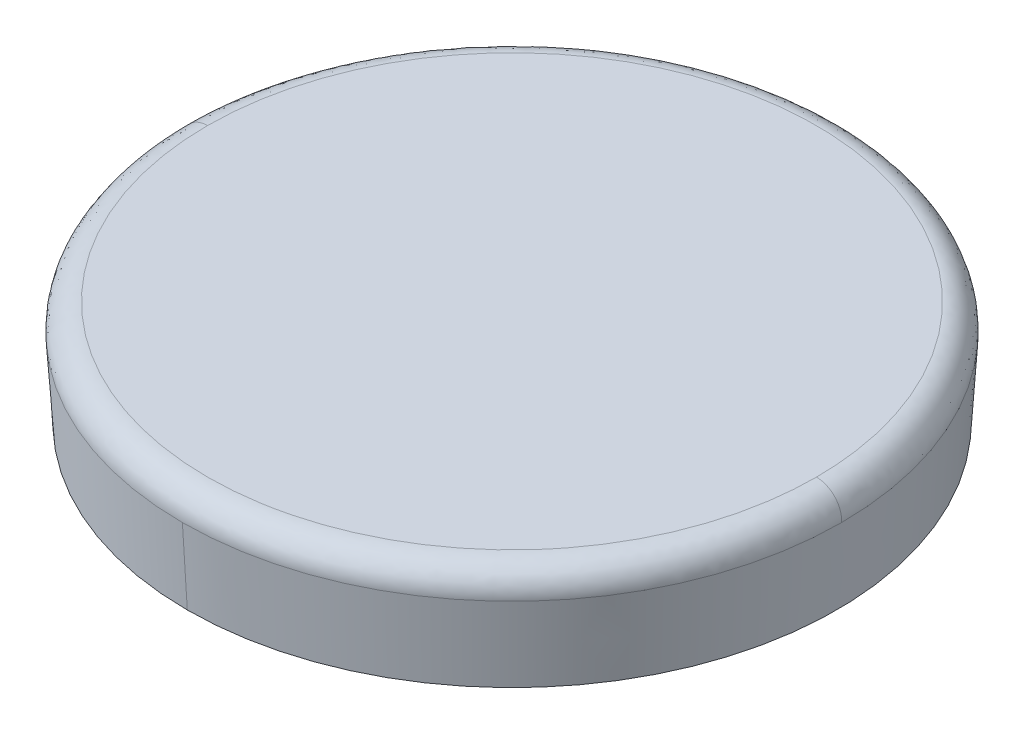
ISO-10303-21;
HEADER;
FILE_DESCRIPTION(('STEP AP214'),'2;1');
FILE_NAME('part.step','',(''),(''),'','','');
FILE_SCHEMA(('AUTOMOTIVE_DESIGN { 1 0 10303 214 1 1 1 1 }'));
ENDSEC;
DATA;
#1=APPLICATION_CONTEXT('core data for automotive mechanical design processes');
#2=APPLICATION_PROTOCOL_DEFINITION('international standard','automotive_design',2000,#1);
#3=PRODUCT_CONTEXT('',#1,'mechanical');
#4=PRODUCT('Part','Part','',(#3));
#5=PRODUCT_RELATED_PRODUCT_CATEGORY('part','',(#4));
#6=PRODUCT_DEFINITION_FORMATION('','',#4);
#7=PRODUCT_DEFINITION_CONTEXT('part definition',#1,'design');
#8=PRODUCT_DEFINITION('design','',#6,#7);
#9=PRODUCT_DEFINITION_SHAPE('','',#8);
#10=(LENGTH_UNIT() NAMED_UNIT(*) SI_UNIT(.MILLI.,.METRE.));
#11=(NAMED_UNIT(*) PLANE_ANGLE_UNIT() SI_UNIT($,.RADIAN.));
#12=(NAMED_UNIT(*) SI_UNIT($,.STERADIAN.) SOLID_ANGLE_UNIT());
#13=UNCERTAINTY_MEASURE_WITH_UNIT(LENGTH_MEASURE(1.E-05),#10,'distance_accuracy_value','');
#14=(GEOMETRIC_REPRESENTATION_CONTEXT(3) GLOBAL_UNCERTAINTY_ASSIGNED_CONTEXT((#13)) GLOBAL_UNIT_ASSIGNED_CONTEXT((#10,
#11,#12)) REPRESENTATION_CONTEXT('',''));
#15=CARTESIAN_POINT('',(0.,0.,0.));
#16=DIRECTION('',(0.,0.,1.));
#17=DIRECTION('',(1.,0.,0.));
#18=AXIS2_PLACEMENT_3D('',#15,#16,#17);
#19=CARTESIAN_POINT('',(-3.61599508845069,13.2498648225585,-2.75));
#20=CARTESIAN_POINT('',(-3.61599508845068,13.2498648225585,4.48199017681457));
#21=CARTESIAN_POINT('',(3.61599508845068,13.2498648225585,4.48199017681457));
#22=CARTESIAN_POINT('',(3.61599508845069,13.2498648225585,-2.75));
#23=CARTESIAN_POINT('',(-3.80475791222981,13.2555333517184,-2.75));
#24=CARTESIAN_POINT('',(-3.80475791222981,13.2555333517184,4.85951582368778));
#25=CARTESIAN_POINT('',(3.80475791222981,13.2555333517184,4.85951582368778));
#26=CARTESIAN_POINT('',(3.80475791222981,13.2555333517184,-2.75));
#27=CARTESIAN_POINT('',(-3.93676554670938,13.1198054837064,-2.75));
#28=CARTESIAN_POINT('',(-3.93676554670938,13.1198054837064,5.1235310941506));
#29=CARTESIAN_POINT('',(3.93676554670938,13.1198054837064,5.1235310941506));
#30=CARTESIAN_POINT('',(3.93676554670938,13.1198054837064,-2.75));
#31=CARTESIAN_POINT('',(-3.92435848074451,12.9303913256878,-2.75));
#32=CARTESIAN_POINT('',(-3.92435848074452,12.9303913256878,5.0987169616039));
#33=CARTESIAN_POINT('',(3.92435848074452,12.9303913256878,5.0987169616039));
#34=CARTESIAN_POINT('',(3.92435848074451,12.9303913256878,-2.75));
#35=(BOUNDED_SURFACE() B_SPLINE_SURFACE(3,3,((#19,#20,#21,#22),(#23,#24,#25,#26),(#27,#28,#29,
#30),(#31,#32,#33,#34)),.UNSPECIFIED.,.F.,.F.,.F.) B_SPLINE_SURFACE_WITH_KNOTS((4,4),(4,4),
(0.0433589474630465,0.94015159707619),(0.,1.),
.UNSPECIFIED.) GEOMETRIC_REPRESENTATION_ITEM() RATIONAL_B_SPLINE_SURFACE(((0.96751722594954,
0.32250574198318,0.32250574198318,0.96751722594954),(0.753720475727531,0.251240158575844,
0.251240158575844,0.753720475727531),(0.749860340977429,0.249953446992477,0.249953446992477,
0.749860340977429),(0.955936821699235,0.318645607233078,0.318645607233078,0.955936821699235))) REPRESENTATION_ITEM('') SURFACE());
#36=CARTESIAN_POINT('',(0.,12.931231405,-2.75));
#37=DIRECTION('',(0.,1.,0.));
#38=DIRECTION('',(-1.,0.,0.));
#39=AXIS2_PLACEMENT_3D('',#36,#37,#38);
#40=CIRCLE('',#39,3.924412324);
#41=CARTESIAN_POINT('',(-3.92441232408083,12.9312314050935,-2.75));
#42=VERTEX_POINT('',#41);
#43=CARTESIAN_POINT('',(0.,12.931231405,1.174412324));
#44=VERTEX_POINT('',#43);
#45=EDGE_CURVE('E77',#42,#44,#40,.T.);
#46=CARTESIAN_POINT('',(0.,12.931231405,-2.75));
#47=DIRECTION('',(0.,1.,0.));
#48=DIRECTION('',(-1.,0.,0.));
#49=AXIS2_PLACEMENT_3D('',#46,#47,#48);
#50=CIRCLE('',#49,3.924412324);
#51=CARTESIAN_POINT('',(3.92441232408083,12.9312314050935,-2.75000000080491));
#52=VERTEX_POINT('',#51);
#53=EDGE_CURVE('E102',#44,#52,#50,.T.);
#54=CARTESIAN_POINT('',(3.92441232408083,12.9312314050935,-2.75000000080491));
#55=CARTESIAN_POINT('',(3.93596043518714,13.1154565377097,-2.75));
#56=CARTESIAN_POINT('',(3.8095867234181,13.2500000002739,-2.75));
#57=CARTESIAN_POINT('',(3.62499999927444,13.250000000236,-2.75));
#58=(BOUNDED_CURVE() B_SPLINE_CURVE(3,(#54,#55,#56,#57),.UNSPECIFIED.,.F.,
.F.) B_SPLINE_CURVE_WITH_KNOTS((4,4),(0.0615373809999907,0.938462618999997),
.UNSPECIFIED.) CURVE() GEOMETRIC_REPRESENTATION_ITEM() RATIONAL_B_SPLINE_CURVE((0.95477471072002,
0.754036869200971,0.754036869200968,0.954774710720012)) REPRESENTATION_ITEM(''));
#59=CARTESIAN_POINT('',(3.62499999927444,13.250000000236,-2.75));
#60=VERTEX_POINT('',#59);
#61=EDGE_CURVE('E105',#52,#60,#58,.T.);
#62=CARTESIAN_POINT('',(-3.62499999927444,13.250000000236,-2.75));
#63=CARTESIAN_POINT('',(-3.62499999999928,13.25,-2.5774680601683));
#64=CARTESIAN_POINT('',(-3.60687499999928,13.25,-2.32119410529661));
#65=CARTESIAN_POINT('',(-3.55401041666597,13.25,-2.02662474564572));
#66=CARTESIAN_POINT('',(-3.5196484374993,13.25,-1.88044429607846));
#67=CARTESIAN_POINT('',(-3.50048502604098,13.25,-1.80763012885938));
#68=CARTESIAN_POINT('',(-3.49184733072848,13.25,-1.77648321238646));
#69=CARTESIAN_POINT('',(-3.48599446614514,13.25,-1.75573174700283));
#70=CARTESIAN_POINT('',(-3.48359162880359,13.25,-1.74732062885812));
#71=CARTESIAN_POINT('',(-3.45126696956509,13.25,-1.63643496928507));
#72=CARTESIAN_POINT('',(-3.40202056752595,13.25,-1.49082580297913));
#73=CARTESIAN_POINT('',(-3.33380943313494,13.25,-1.32486560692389));
#74=CARTESIAN_POINT('',(-3.29701461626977,13.25,-1.24286480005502));
#75=CARTESIAN_POINT('',(-3.28066914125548,13.25,-1.20793144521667));
#76=CARTESIAN_POINT('',(-3.26964409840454,13.25,-1.18468917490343));
#77=CARTESIAN_POINT('',(-3.26471933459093,13.25,-1.17442882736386));
#78=CARTESIAN_POINT('',(-3.20808801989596,13.25,-1.05822106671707));
#79=CARTESIAN_POINT('',(-3.12553043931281,13.25,-0.907434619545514));
#80=CARTESIAN_POINT('',(-3.01687723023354,13.25,-0.738792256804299));
#81=CARTESIAN_POINT('',(-2.95946661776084,13.25,-0.656289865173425));
#82=CARTESIAN_POINT('',(-2.93420121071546,13.25,-0.621321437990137));
#83=CARTESIAN_POINT('',(-2.91721074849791,13.25,-0.598095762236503));
#84=CARTESIAN_POINT('',(-2.9095245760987,13.25,-0.587703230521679));
#85=CARTESIAN_POINT('',(-2.82380339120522,13.25,-0.473374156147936));
#86=CARTESIAN_POINT('',(-2.70210114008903,13.25,-0.327634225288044));
#87=CARTESIAN_POINT('',(-2.54715233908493,13.25,-0.169327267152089));
#88=CARTESIAN_POINT('',(-2.46643722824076,13.25,-0.0931045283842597));
#89=CARTESIAN_POINT('',(-2.4311505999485,13.25,-0.0610656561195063));
#90=CARTESIAN_POINT('',(-2.4074718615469,13.25,-0.039845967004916));
#91=CARTESIAN_POINT('',(-2.39654916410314,13.25,-0.0301734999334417));
#92=CARTESIAN_POINT('',(-2.27966148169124,13.25,0.0718674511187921));
#93=CARTESIAN_POINT('',(-2.11702644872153,13.25,0.198315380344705));
#94=CARTESIAN_POINT('',(-1.91541219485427,13.25,0.329026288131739));
#95=CARTESIAN_POINT('',(-1.82646178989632,13.25,0.381442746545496));
#96=CARTESIAN_POINT('',(-1.7665961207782,13.25,0.415586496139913));
#97=CARTESIAN_POINT('',(-1.73814931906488,13.25,0.43131444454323));
#98=CARTESIAN_POINT('',(-1.57681448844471,13.25,0.51738928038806));
#99=CARTESIAN_POINT('',(-1.37831675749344,13.25,0.608400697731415));
#100=CARTESIAN_POINT('',(-1.17247512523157,13.25,0.680994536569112));
#101=CARTESIAN_POINT('',(-1.03361539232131,13.25,0.725297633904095));
#102=CARTESIAN_POINT('',(-0.965413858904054,13.25,0.744883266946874));
#103=CARTESIAN_POINT('',(-0.59988302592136,13.25,0.837774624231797));
#104=CARTESIAN_POINT('',(-0.301719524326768,13.25,0.874954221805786));
#105=CARTESIAN_POINT('',(0.150859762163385,13.25,0.87502288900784));
#106=CARTESIAN_POINT('',(0.375543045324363,13.25,0.861097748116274));
#107=CARTESIAN_POINT('',(0.634862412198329,13.25,0.820422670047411));
#108=CARTESIAN_POINT('',(0.745396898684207,13.25,0.797755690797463));
#109=CARTESIAN_POINT('',(0.818952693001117,13.25,0.781481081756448));
#110=CARTESIAN_POINT('',(0.856859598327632,13.25,0.772458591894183));
#111=CARTESIAN_POINT('',(1.03410006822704,13.25,0.727473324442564));
#112=CARTESIAN_POINT('',(1.24214118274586,13.25,0.661115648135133));
#113=CARTESIAN_POINT('',(1.47672277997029,13.25,0.5620414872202));
#114=CARTESIAN_POINT('',(1.57551495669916,13.25,0.514940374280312));
#115=CARTESIAN_POINT('',(1.64098912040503,13.25,0.482508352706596));
#116=CARTESIAN_POINT('',(1.67545622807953,13.25,0.464751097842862));
#117=CARTESIAN_POINT('',(1.82758685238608,13.25,0.383642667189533));
#118=CARTESIAN_POINT('',(2.0035751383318,13.25,0.276556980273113));
#119=CARTESIAN_POINT('',(2.19739999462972,13.25,0.134551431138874));
#120=CARTESIAN_POINT('',(2.29143872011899,13.25,0.0592805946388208));
#121=CARTESIAN_POINT('',(2.33112523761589,13.25,0.0261070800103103));
#122=CARTESIAN_POINT('',(2.35744607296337,13.25,0.0037881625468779));
#123=CARTESIAN_POINT('',(2.37159775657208,13.25,-0.00839746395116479));
#124=CARTESIAN_POINT('',(2.47927274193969,13.25,-0.102340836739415));
#125=CARTESIAN_POINT('',(2.61561086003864,13.25,-0.234490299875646));
#126=CARTESIAN_POINT('',(2.76202207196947,13.25,-0.400725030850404));
#127=CARTESIAN_POINT('',(2.83206519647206,13.25,-0.486857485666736));
#128=CARTESIAN_POINT('',(2.86140600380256,13.25,-0.524417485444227));
#129=CARTESIAN_POINT('',(2.88081594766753,13.25,-0.549601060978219));
#130=CARTESIAN_POINT('',(2.89138019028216,13.25,-0.563510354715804));
#131=CARTESIAN_POINT('',(2.96895847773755,13.25,-0.666917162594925));
#132=CARTESIAN_POINT('',(3.06548070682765,13.25,-0.809169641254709));
#133=CARTESIAN_POINT('',(3.16598787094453,13.25,-0.982790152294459));
#134=CARTESIAN_POINT('',(3.21321592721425,13.25,-1.07151522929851));
#135=CARTESIAN_POINT('',(3.23280819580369,13.25,-1.1099505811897));
#136=CARTESIAN_POINT('',(3.24572563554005,13.25,-1.1356653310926));
#137=CARTESIAN_POINT('',(3.25280171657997,13.25,-1.14998194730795));
#138=CARTESIAN_POINT('',(3.30342896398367,13.25,-1.25379610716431));
#139=CARTESIAN_POINT('',(3.36487709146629,13.25,-1.39469094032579));
#140=CARTESIAN_POINT('',(3.42597055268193,13.25,-1.56340116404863));
#141=CARTESIAN_POINT('',(3.45386827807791,13.25,-1.648839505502));
#142=CARTESIAN_POINT('',(3.46525680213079,13.25,-1.68568805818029));
#143=CARTESIAN_POINT('',(3.47272300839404,13.25,-1.71030534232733));
#144=CARTESIAN_POINT('',(3.4768125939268,13.25,-1.72407749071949));
#145=CARTESIAN_POINT('',(3.50549924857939,13.25,-1.82238007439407));
#146=CARTESIAN_POINT('',(3.53873872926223,13.25,-1.95464079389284));
#147=CARTESIAN_POINT('',(3.56875168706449,13.25,-2.11102853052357));
#148=CARTESIAN_POINT('',(3.58156655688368,13.25,-2.18974328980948));
#149=CARTESIAN_POINT('',(3.5865890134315,13.25,-2.22358980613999));
#150=CARTESIAN_POINT('',(3.58983295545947,13.25,-2.24617895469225));
#151=CARTESIAN_POINT('',(3.59158370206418,13.25,-2.25883563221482));
#152=CARTESIAN_POINT('',(3.61430678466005,13.25,-2.42832015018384));
#153=CARTESIAN_POINT('',(3.62499999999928,13.25,-2.5887183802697));
#154=CARTESIAN_POINT('',(3.62499999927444,13.250000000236,-2.75));
#155=(BOUNDED_CURVE() B_SPLINE_CURVE(3,(#62,#63,#64,#65,#66,#67,#68,#69,#70,#71,#72,#73,#74,#75,
#76,#77,#78,#79,#80,#81,#82,#83,#84,#85,#86,#87,#88,#89,#90,#91,#92,#93,#94,#95,#96,#97,#98,#99,
#100,#101,#102,#103,#104,#105,#106,#107,#108,#109,#110,#111,#112,#113,#114,#115,#116,#117,#118,
#119,#120,#121,#122,#123,#124,#125,#126,#127,#128,#129,#130,#131,#132,#133,#134,#135,#136,#137,
#138,#139,#140,#141,#142,#143,#144,#145,#146,#147,#148,#149,#150,#151,#152,#153,#154),
.UNSPECIFIED.,.F.,.F.) B_SPLINE_CURVE_WITH_KNOTS((4,1,1,1,1,2,2,1,1,1,2,2,1,1,1,2,2,1,1,1,2,2,1,
1,2,2,1,2,2,2,1,1,2,2,1,1,2,2,1,1,1,2,2,1,1,1,2,2,1,1,1,2,2,1,1,1,2,2,1,1,1,2,2,4),(0.,0.0625,
0.09375,0.109375,0.1171875,0.12109375,0.125,0.15625,0.171875,0.1796875,0.18359375,0.1875,
0.21875,0.234375,0.2421875,0.24609375,0.25,0.28125,0.296875,0.3046875,0.30859375,0.3125,0.34375,
0.359375,0.3671875,0.375,0.40625,0.421875,0.4375,0.5,0.53125,0.546875,0.5546875,0.5625,0.59375,
0.609375,0.6171875,0.625,0.65625,0.671875,0.6796875,0.683593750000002,0.6875,0.71875,0.734375,
0.7421875,0.746093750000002,0.75,0.78125,0.796875,0.8046875,0.808593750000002,0.8125,0.84375,
0.859375,0.8671875,0.871093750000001,0.875,0.90625,0.921875,0.9296875,0.933593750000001,0.9375,
1.),.UNSPECIFIED.) CURVE() GEOMETRIC_REPRESENTATION_ITEM() RATIONAL_B_SPLINE_CURVE((1.,1.,1.,1.,
1.,1.,1.,1.,1.,1.,1.,1.,1.,1.,1.,1.,1.,1.,1.,1.,1.,1.,1.,1.,1.,1.,1.,1.,1.,1.,1.,1.,1.,1.,1.,1.,
1.,1.,1.,1.,1.,1.,1.,1.,1.,1.,1.,1.,1.,1.,1.,1.,1.,1.,1.,1.,1.,1.,1.,1.,1.,1.,1.,1.,1.,1.,1.,1.,
1.,1.,1.,1.,1.,1.,1.,1.,1.,1.,1.,1.,1.,1.,1.,1.,1.,1.,1.,1.,1.,1.,1.,1.,1.)) REPRESENTATION_ITEM(''));
#156=CARTESIAN_POINT('',(-3.62499999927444,13.250000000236,-2.75));
#157=VERTEX_POINT('',#156);
#158=EDGE_CURVE('E10',#157,#60,#155,.T.);
#159=CARTESIAN_POINT('',(-3.62499999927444,13.250000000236,-2.75));
#160=CARTESIAN_POINT('',(-3.8095867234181,13.2500000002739,-2.75));
#161=CARTESIAN_POINT('',(-3.93596043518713,13.1154565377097,-2.75));
#162=CARTESIAN_POINT('',(-3.92441232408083,12.9312314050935,-2.75));
#163=(BOUNDED_CURVE() B_SPLINE_CURVE(3,(#159,#160,#161,#162),.UNSPECIFIED.,.F.,
.F.) B_SPLINE_CURVE_WITH_KNOTS((4,4),(0.0615373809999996,0.938462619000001),
.UNSPECIFIED.) CURVE() GEOMETRIC_REPRESENTATION_ITEM() RATIONAL_B_SPLINE_CURVE((0.954774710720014,
0.75403686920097,0.75403686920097,0.954774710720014)) REPRESENTATION_ITEM(''));
#164=EDGE_CURVE('E116',#157,#42,#163,.T.);
#165=ORIENTED_EDGE('',*,*,#45,.T.);
#166=ORIENTED_EDGE('',*,*,#53,.T.);
#167=ORIENTED_EDGE('',*,*,#61,.T.);
#168=ORIENTED_EDGE('',*,*,#158,.F.);
#169=ORIENTED_EDGE('',*,*,#164,.T.);
#170=EDGE_LOOP('',(#165,#166,#167,#168,#169));
#171=FACE_BOUND('',#170,.T.);
#172=ADVANCED_FACE('F15',(#171),#35,.T.);
#173=CARTESIAN_POINT('',(3.6685,13.25,-6.4185));
#174=DIRECTION('',(0.,1.,0.));
#175=DIRECTION('',(1.,0.,0.));
#176=AXIS2_PLACEMENT_3D('',#173,#174,#175);
#177=PLANE('',#176);
#178=CARTESIAN_POINT('',(-3.62499999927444,13.250000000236,-2.75));
#179=CARTESIAN_POINT('',(-3.62499999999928,13.2500000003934,-9.99999999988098));
#180=CARTESIAN_POINT('',(3.62499999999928,13.2500000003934,-9.99999999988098));
#181=CARTESIAN_POINT('',(3.62499999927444,13.250000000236,-2.75));
#182=(BOUNDED_CURVE() B_SPLINE_CURVE(3,(#178,#179,#180,#181),.UNSPECIFIED.,.F.,
.F.) B_SPLINE_CURVE_WITH_KNOTS((4,4),(0.,1.),
.UNSPECIFIED.) CURVE() GEOMETRIC_REPRESENTATION_ITEM() RATIONAL_B_SPLINE_CURVE((0.95477471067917,
0.318258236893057,0.318258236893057,0.95477471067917)) REPRESENTATION_ITEM(''));
#183=EDGE_CURVE('E19',#157,#60,#182,.T.);
#184=ORIENTED_EDGE('',*,*,#183,.F.);
#185=ORIENTED_EDGE('',*,*,#158,.T.);
#186=EDGE_LOOP('',(#184,#185));
#187=FACE_BOUND('',#186,.T.);
#188=ADVANCED_FACE('F17',(#187),#177,.T.);
#189=CARTESIAN_POINT('',(-3.912430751,12.,1.162430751));
#190=DIRECTION('',(0.,-1.,0.));
#191=DIRECTION('',(0.,0.,-1.));
#192=AXIS2_PLACEMENT_3D('',#189,#190,#191);
#193=PLANE('',#192);
#194=CARTESIAN_POINT('',(0.,12.,-2.75));
#195=DIRECTION('',(0.,-1.,0.));
#196=DIRECTION('',(0.,0.,1.));
#197=AXIS2_PLACEMENT_3D('',#194,#195,#196);
#198=CIRCLE('',#197,3.86603829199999);
#199=CARTESIAN_POINT('',(0.,12.,1.11603829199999));
#200=VERTEX_POINT('',#199);
#201=CARTESIAN_POINT('',(0.,12.,-6.61603829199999));
#202=VERTEX_POINT('',#201);
#203=EDGE_CURVE('E68',#200,#202,#198,.T.);
#204=ORIENTED_EDGE('',*,*,#203,.T.);
#205=CARTESIAN_POINT('',(0.,12.,-2.75));
#206=DIRECTION('',(0.,-1.,0.));
#207=DIRECTION('',(0.,0.,1.));
#208=AXIS2_PLACEMENT_3D('',#205,#206,#207);
#209=CIRCLE('',#208,3.86603829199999);
#210=EDGE_CURVE('E72',#202,#200,#209,.T.);
#211=ORIENTED_EDGE('',*,*,#210,.T.);
#212=EDGE_LOOP('',(#204,#211));
#213=FACE_BOUND('',#212,.T.);
#214=ADVANCED_FACE('F70',(#213),#193,.T.);
#215=CARTESIAN_POINT('',(3.62415819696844,13.2499988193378,-2.75));
#216=CARTESIAN_POINT('',(3.62415819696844,13.2499988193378,-9.99831639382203));
#217=CARTESIAN_POINT('',(-3.62415819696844,13.2499988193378,-9.99831639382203));
#218=CARTESIAN_POINT('',(-3.62415819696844,13.2499988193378,-2.75));
#219=CARTESIAN_POINT('',(3.80955046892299,13.2505190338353,-2.75));
#220=CARTESIAN_POINT('',(3.80955046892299,13.2505190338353,-10.3691009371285));
#221=CARTESIAN_POINT('',(-3.80955046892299,13.2505190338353,-10.3691009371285));
#222=CARTESIAN_POINT('',(-3.80955046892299,13.2505190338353,-2.75));
#223=CARTESIAN_POINT('',(3.93647618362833,13.1153878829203,-2.75));
#224=CARTESIAN_POINT('',(3.93647618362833,13.1153878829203,-10.6229523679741));
#225=CARTESIAN_POINT('',(-3.93647618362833,13.1153878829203,-10.6229523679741));
#226=CARTESIAN_POINT('',(-3.93647618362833,13.1153878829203,-2.75));
#227=CARTESIAN_POINT('',(3.92435848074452,12.9303913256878,-2.75));
#228=CARTESIAN_POINT('',(3.92435848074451,12.9303913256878,-10.5987169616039));
#229=CARTESIAN_POINT('',(-3.92435848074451,12.9303913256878,-10.5987169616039));
#230=CARTESIAN_POINT('',(-3.92435848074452,12.9303913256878,-2.75));
#231=(BOUNDED_SURFACE() B_SPLINE_SURFACE(3,3,((#215,#216,#217,#218),(#219,#220,#221,#222),(#223,
#224,#225,#226),(#227,#228,#229,#230)),.UNSPECIFIED.,.F.,.F.,
.F.) B_SPLINE_SURFACE_WITH_KNOTS((4,4),(4,4),(0.0598484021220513,0.940151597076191),(0.,1.),
.UNSPECIFIED.) GEOMETRIC_REPRESENTATION_ITEM() RATIONAL_B_SPLINE_SURFACE(((0.95593682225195,
0.318645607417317,0.318645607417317,0.95593682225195),(0.753649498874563,0.251216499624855,
0.251216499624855,0.753649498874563),(0.753649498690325,0.251216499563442,0.251216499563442,
0.753649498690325),(0.955936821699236,0.318645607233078,0.318645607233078,0.955936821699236))) REPRESENTATION_ITEM('') SURFACE());
#232=CARTESIAN_POINT('',(0.,12.931231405,-2.75));
#233=DIRECTION('',(0.,1.,0.));
#234=DIRECTION('',(-1.,0.,0.));
#235=AXIS2_PLACEMENT_3D('',#232,#233,#234);
#236=CIRCLE('',#235,3.924412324);
#237=CARTESIAN_POINT('',(0.,12.931231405,-6.674412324));
#238=VERTEX_POINT('',#237);
#239=EDGE_CURVE('E90',#52,#238,#236,.T.);
#240=CARTESIAN_POINT('',(0.,12.931231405,-2.75));
#241=DIRECTION('',(0.,1.,0.));
#242=DIRECTION('',(-1.,0.,0.));
#243=AXIS2_PLACEMENT_3D('',#240,#241,#242);
#244=CIRCLE('',#243,3.924412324);
#245=EDGE_CURVE('E85',#238,#42,#244,.T.);
#246=ORIENTED_EDGE('',*,*,#61,.F.);
#247=ORIENTED_EDGE('',*,*,#239,.T.);
#248=ORIENTED_EDGE('',*,*,#245,.T.);
#249=ORIENTED_EDGE('',*,*,#164,.F.);
#250=ORIENTED_EDGE('',*,*,#183,.T.);
#251=EDGE_LOOP('',(#246,#247,#248,#249,#250));
#252=FACE_BOUND('',#251,.T.);
#253=ADVANCED_FACE('F132',(#252),#231,.T.);
#254=CARTESIAN_POINT('',(0.,12.,-2.75));
#255=DIRECTION('',(0.,1.,0.));
#256=DIRECTION('',(0.,0.,1.));
#257=AXIS2_PLACEMENT_3D('',#254,#255,#256);
#258=CONICAL_SURFACE('',#257,3.866038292,0.0626028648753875);
#259=DIRECTION('',(0.,0.998041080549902,-0.062561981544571));
#260=VECTOR('',#259,1.);
#261=CARTESIAN_POINT('',(0.,12.,-6.616038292));
#262=LINE('',#261,#260);
#263=EDGE_CURVE('E81',#202,#238,#262,.T.);
#264=ORIENTED_EDGE('',*,*,#263,.F.);
#265=ORIENTED_EDGE('',*,*,#203,.F.);
#266=DIRECTION('',(0.,0.998041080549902,0.062561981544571));
#267=VECTOR('',#266,1.);
#268=CARTESIAN_POINT('',(0.,12.,1.116038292));
#269=LINE('',#268,#267);
#270=EDGE_CURVE('E78',#200,#44,#269,.T.);
#271=ORIENTED_EDGE('',*,*,#270,.T.);
#272=ORIENTED_EDGE('',*,*,#45,.F.);
#273=ORIENTED_EDGE('',*,*,#245,.F.);
#274=EDGE_LOOP('',(#264,#265,#271,#272,#273));
#275=FACE_BOUND('',#274,.T.);
#276=ADVANCED_FACE('F82',(#275),#258,.T.);
#277=CARTESIAN_POINT('',(0.,12.,-2.75));
#278=DIRECTION('',(0.,1.,0.));
#279=DIRECTION('',(0.,0.,1.));
#280=AXIS2_PLACEMENT_3D('',#277,#278,#279);
#281=CONICAL_SURFACE('',#280,3.866038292,0.0626028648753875);
#282=ORIENTED_EDGE('',*,*,#210,.F.);
#283=ORIENTED_EDGE('',*,*,#263,.T.);
#284=ORIENTED_EDGE('',*,*,#239,.F.);
#285=ORIENTED_EDGE('',*,*,#53,.F.);
#286=ORIENTED_EDGE('',*,*,#270,.F.);
#287=EDGE_LOOP('',(#282,#283,#284,#285,#286));
#288=FACE_BOUND('',#287,.T.);
#289=ADVANCED_FACE('F92',(#288),#281,.T.);
#290=CLOSED_SHELL('',(#172,#188,#214,#253,#276,#289));
#291=MANIFOLD_SOLID_BREP('B1',#290);
#292=ADVANCED_BREP_SHAPE_REPRESENTATION('',(#18,#291),#14);
#293=SHAPE_DEFINITION_REPRESENTATION(#9,#292);
ENDSEC;
END-ISO-10303-21;
